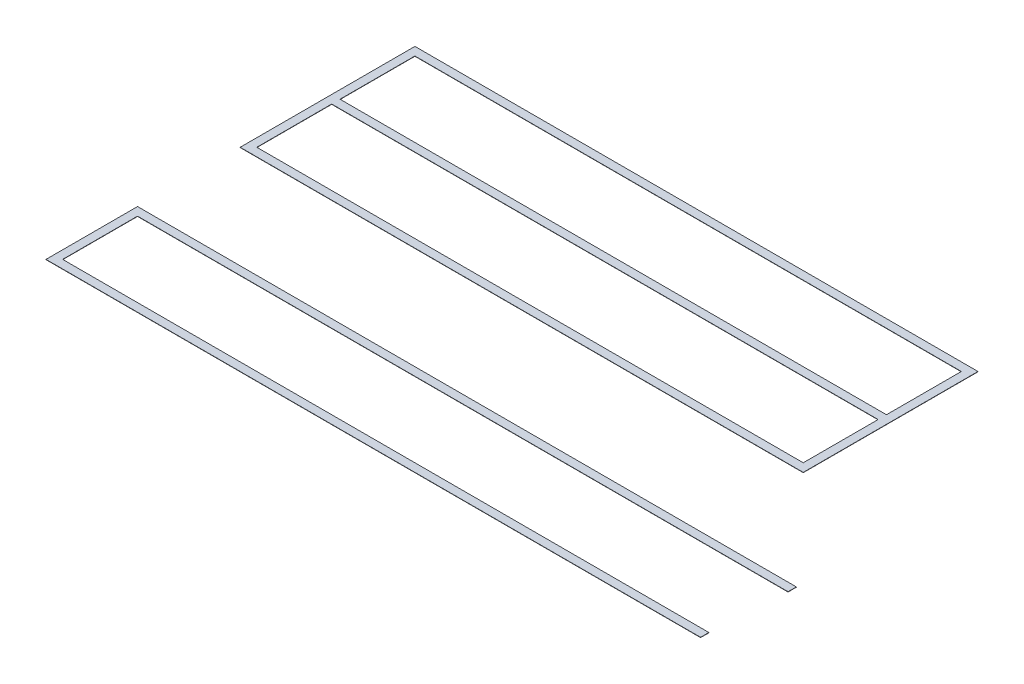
from build123d import *

# Parameters (mm, degrees)
EXTRUSION1_DEPTH   = 1
ESQUISSE1_W        = 2030
ESQUISSE1_H        = 630
ESQUISSE1_W_2      = 1970
ESQUISSE1_H_2      = 270
EXTRUSION1_2_DEPTH = 1


with BuildPart() as part:
    # Esquisse1 → Extrusion1 (new body)
    with BuildSketch(Plane(origin=(0, 0, 0), x_dir=(1, 0, 0), z_dir=(0, 1, 0))):
        Polygon((1360.219624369, -185), (1360.219624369, -215), (-985, -215), (-985, -485), (1344.868220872, -485), (1344.868220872, -515), (-1015, -515), (-1015, -185), align=None)
    extrude(amount=EXTRUSION1_DEPTH)


with BuildPart() as body_2:
    # Esquisse1 → Extrusion1 2 (new body)
    with BuildSketch(Plane(origin=(0, 0, 0), x_dir=(1, 0, 0), z_dir=(0, 1, 0))):
        with Locations((0, 500)):
            Rectangle(ESQUISSE1_W, ESQUISSE1_H)
        with Locations((0, 350)):
            Rectangle(ESQUISSE1_W_2, ESQUISSE1_H_2, mode=Mode.SUBTRACT)
        with Locations((0, 650)):
            Rectangle(ESQUISSE1_W_2, ESQUISSE1_H_2, mode=Mode.SUBTRACT)
    extrude(amount=EXTRUSION1_2_DEPTH)


solid = Compound([part.part, body_2.part])
